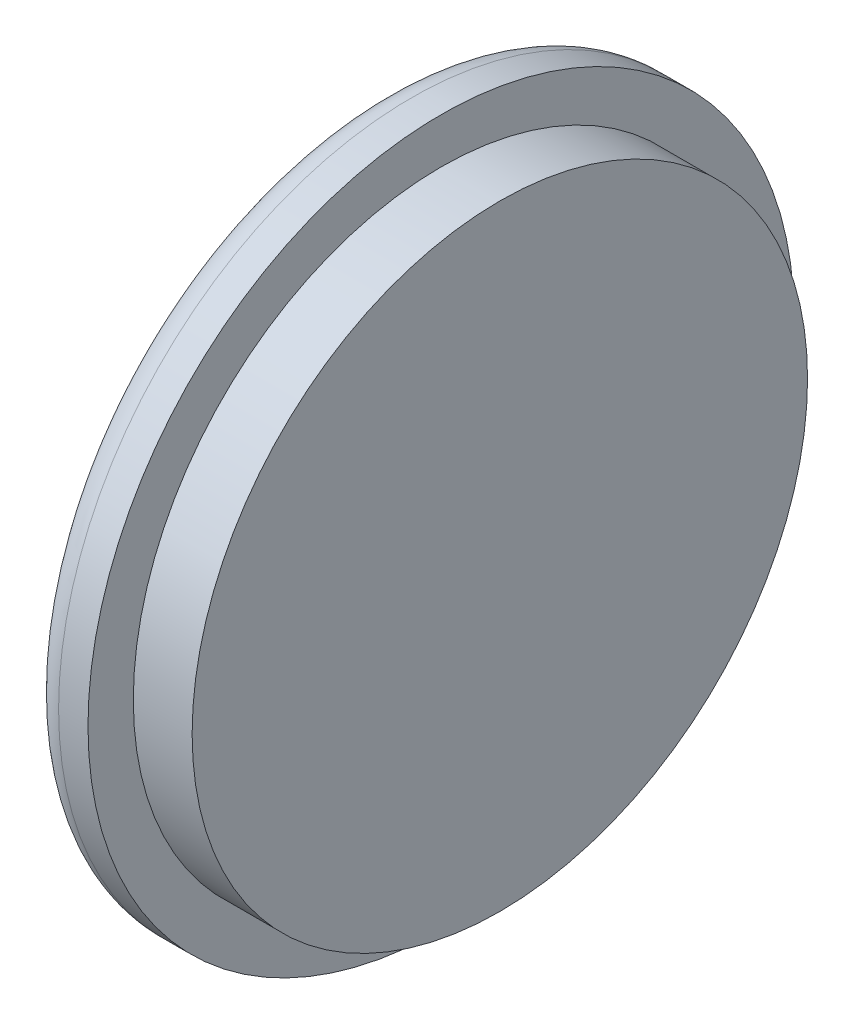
from build123d import *

# Parameters (mm, degrees)
FILLET1_R = 3.175


with BuildPart() as part:
    # Sketch1 → Revolve1 (revolve)
    with BuildSketch(Plane.XY, mode=Mode.PRIVATE) as revolve1_sk:
        Polygon((0, 0), (0, 38.1), (6.35, 38.1), (6.35, 33.2105), (12.7, 33.2105), (12.7, 0), align=None)
    revolve(revolve1_sk.sketch.rotate(Axis((0, 0, 0), (1, 0, 0)), 90), axis=Axis((0, 0, 0), (1, 0, 0)))

    # Fillet1
    fillet1_edges = [part.edges().sort_by_distance(p)[0] for p in [
        (0, 0, -38.1),
    ]]
    fillet(fillet1_edges, radius=FILLET1_R)


solid = part.part
